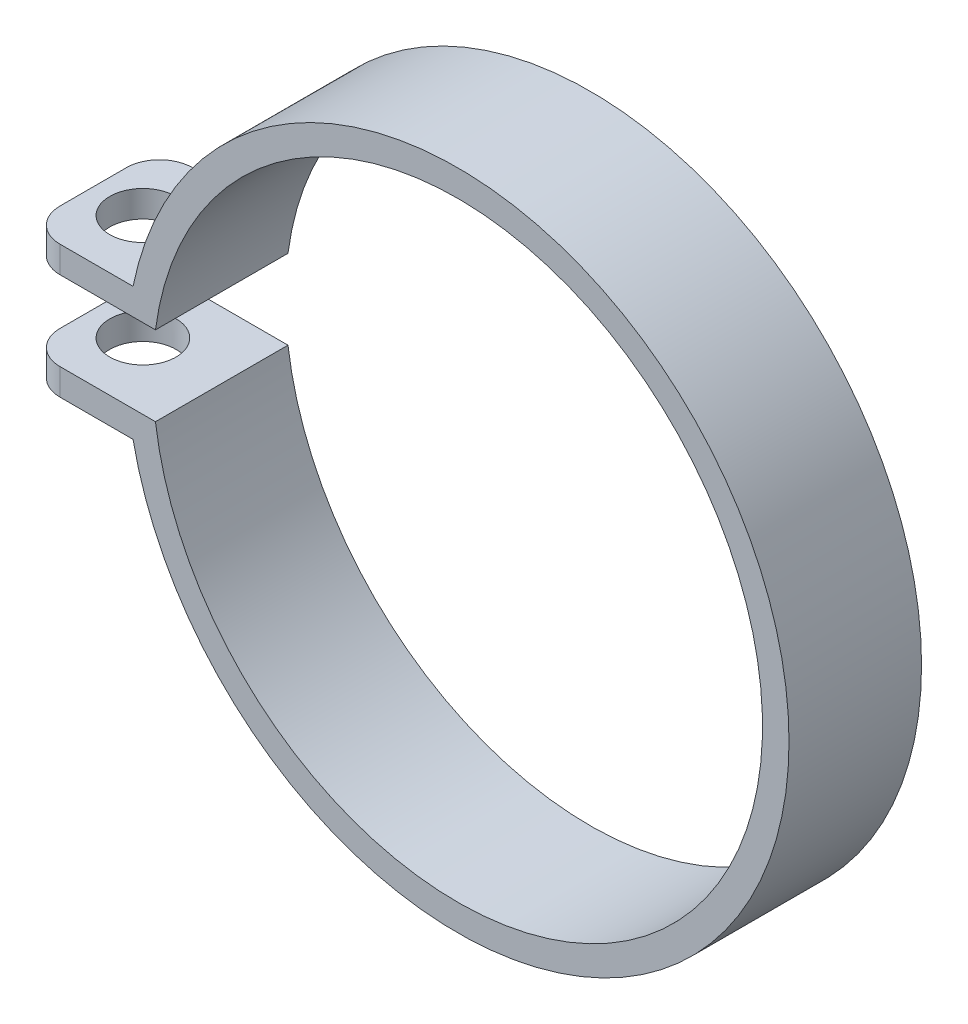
ISO-10303-21;
HEADER;
FILE_DESCRIPTION(('STEP AP214'),'2;1');
FILE_NAME('part.step','',(''),(''),'','','');
FILE_SCHEMA(('AUTOMOTIVE_DESIGN { 1 0 10303 214 1 1 1 1 }'));
ENDSEC;
DATA;
#1=APPLICATION_CONTEXT('core data for automotive mechanical design processes');
#2=APPLICATION_PROTOCOL_DEFINITION('international standard','automotive_design',2000,#1);
#3=PRODUCT_CONTEXT('',#1,'mechanical');
#4=PRODUCT('Part','Part','',(#3));
#5=PRODUCT_RELATED_PRODUCT_CATEGORY('part','',(#4));
#6=PRODUCT_DEFINITION_FORMATION('','',#4);
#7=PRODUCT_DEFINITION_CONTEXT('part definition',#1,'design');
#8=PRODUCT_DEFINITION('design','',#6,#7);
#9=PRODUCT_DEFINITION_SHAPE('','',#8);
#10=(LENGTH_UNIT() NAMED_UNIT(*) SI_UNIT(.MILLI.,.METRE.));
#11=(NAMED_UNIT(*) PLANE_ANGLE_UNIT() SI_UNIT($,.RADIAN.));
#12=(NAMED_UNIT(*) SI_UNIT($,.STERADIAN.) SOLID_ANGLE_UNIT());
#13=UNCERTAINTY_MEASURE_WITH_UNIT(LENGTH_MEASURE(1.E-05),#10,'distance_accuracy_value','');
#14=(GEOMETRIC_REPRESENTATION_CONTEXT(3) GLOBAL_UNCERTAINTY_ASSIGNED_CONTEXT((#13)) GLOBAL_UNIT_ASSIGNED_CONTEXT((#10,
#11,#12)) REPRESENTATION_CONTEXT('',''));
#15=CARTESIAN_POINT('',(0.,0.,0.));
#16=DIRECTION('',(0.,0.,1.));
#17=DIRECTION('',(1.,0.,0.));
#18=AXIS2_PLACEMENT_3D('',#15,#16,#17);
#19=CARTESIAN_POINT('',(0.,0.,10.));
#20=DIRECTION('',(0.,0.,-1.));
#21=DIRECTION('',(-1.,0.,0.));
#22=AXIS2_PLACEMENT_3D('',#19,#20,#21);
#23=CYLINDRICAL_SURFACE('',#22,46.);
#24=CARTESIAN_POINT('',(0.,0.,-10.));
#25=DIRECTION('',(0.,0.,-1.));
#26=DIRECTION('',(1.,0.,0.));
#27=AXIS2_PLACEMENT_3D('',#24,#25,#26);
#28=CIRCLE('',#27,46.);
#29=CARTESIAN_POINT('',(-45.6070170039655,5.99999999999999,-10.));
#30=VERTEX_POINT('',#29);
#31=CARTESIAN_POINT('',(-45.6070170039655,-6.00000000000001,-10.));
#32=VERTEX_POINT('',#31);
#33=EDGE_CURVE('E153',#30,#32,#28,.T.);
#34=ORIENTED_EDGE('',*,*,#33,.T.);
#35=DIRECTION('',(0.,0.,-1.));
#36=VECTOR('',#35,1.);
#37=CARTESIAN_POINT('',(-45.6070170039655,-6.00000000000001,10.));
#38=LINE('',#37,#36);
#39=CARTESIAN_POINT('',(-45.6070170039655,-6.00000000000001,10.));
#40=VERTEX_POINT('',#39);
#41=EDGE_CURVE('E132',#40,#32,#38,.T.);
#42=ORIENTED_EDGE('',*,*,#41,.F.);
#43=CARTESIAN_POINT('',(0.,0.,10.));
#44=DIRECTION('',(0.,0.,-1.));
#45=DIRECTION('',(1.,0.,0.));
#46=AXIS2_PLACEMENT_3D('',#43,#44,#45);
#47=CIRCLE('',#46,46.);
#48=CARTESIAN_POINT('',(-45.6070170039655,5.99999999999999,10.));
#49=VERTEX_POINT('',#48);
#50=EDGE_CURVE('E140',#49,#40,#47,.T.);
#51=ORIENTED_EDGE('',*,*,#50,.F.);
#52=DIRECTION('',(0.,0.,-1.));
#53=VECTOR('',#52,1.);
#54=CARTESIAN_POINT('',(-45.6070170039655,5.99999999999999,10.));
#55=LINE('',#54,#53);
#56=EDGE_CURVE('E208',#49,#30,#55,.T.);
#57=ORIENTED_EDGE('',*,*,#56,.T.);
#58=EDGE_LOOP('',(#34,#42,#51,#57));
#59=FACE_BOUND('',#58,.T.);
#60=ADVANCED_FACE('F36',(#59),#23,.F.);
#61=CARTESIAN_POINT('',(-45.6070170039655,-6.00000000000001,10.));
#62=DIRECTION('',(0.,-1.,0.));
#63=DIRECTION('',(0.,0.,-1.));
#64=AXIS2_PLACEMENT_3D('',#61,#62,#63);
#65=PLANE('',#64);
#66=CARTESIAN_POINT('',(-57.5,-6.00000000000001,0.));
#67=DIRECTION('',(0.,-1.,0.));
#68=DIRECTION('',(0.,0.,-1.));
#69=AXIS2_PLACEMENT_3D('',#66,#67,#68);
#70=CIRCLE('',#69,5.);
#71=CARTESIAN_POINT('',(-57.5,-6.00000000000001,-5.));
#72=VERTEX_POINT('',#71);
#73=EDGE_CURVE('E237',#72,#72,#70,.T.);
#74=ORIENTED_EDGE('',*,*,#73,.T.);
#75=EDGE_LOOP('',(#74));
#76=FACE_BOUND('',#75,.T.);
#77=DIRECTION('',(0.,0.,-1.));
#78=VECTOR('',#77,1.);
#79=CARTESIAN_POINT('',(-65.,-6.00000000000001,10.));
#80=LINE('',#79,#78);
#81=CARTESIAN_POINT('',(-65.,-6.00000000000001,5.));
#82=VERTEX_POINT('',#81);
#83=CARTESIAN_POINT('',(-65.,-6.00000000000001,-5.));
#84=VERTEX_POINT('',#83);
#85=EDGE_CURVE('E155',#82,#84,#80,.T.);
#86=ORIENTED_EDGE('',*,*,#85,.F.);
#87=CARTESIAN_POINT('',(-60.,-6.00000000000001,5.));
#88=DIRECTION('',(0.,-1.,0.));
#89=DIRECTION('',(0.,0.,-1.));
#90=AXIS2_PLACEMENT_3D('',#87,#88,#89);
#91=CIRCLE('',#90,5.);
#92=CARTESIAN_POINT('',(-60.,-6.00000000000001,10.));
#93=VERTEX_POINT('',#92);
#94=EDGE_CURVE('E135',#82,#93,#91,.F.);
#95=ORIENTED_EDGE('',*,*,#94,.T.);
#96=DIRECTION('',(-1.,0.,0.));
#97=VECTOR('',#96,1.);
#98=CARTESIAN_POINT('',(-45.6070170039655,-6.00000000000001,10.));
#99=LINE('',#98,#97);
#100=EDGE_CURVE('E126',#40,#93,#99,.T.);
#101=ORIENTED_EDGE('',*,*,#100,.F.);
#102=ORIENTED_EDGE('',*,*,#41,.T.);
#103=DIRECTION('',(-1.,0.,0.));
#104=VECTOR('',#103,1.);
#105=CARTESIAN_POINT('',(-45.6070170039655,-6.00000000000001,-10.));
#106=LINE('',#105,#104);
#107=CARTESIAN_POINT('',(-60.,-6.00000000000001,-10.));
#108=VERTEX_POINT('',#107);
#109=EDGE_CURVE('E236',#32,#108,#106,.T.);
#110=ORIENTED_EDGE('',*,*,#109,.T.);
#111=CARTESIAN_POINT('',(-60.,-6.00000000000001,-5.));
#112=DIRECTION('',(0.,-1.,0.));
#113=DIRECTION('',(0.,0.,-1.));
#114=AXIS2_PLACEMENT_3D('',#111,#112,#113);
#115=CIRCLE('',#114,5.);
#116=EDGE_CURVE('E174',#108,#84,#115,.F.);
#117=ORIENTED_EDGE('',*,*,#116,.T.);
#118=EDGE_LOOP('',(#86,#95,#101,#102,#110,#117));
#119=FACE_BOUND('',#118,.T.);
#120=ADVANCED_FACE('F129',(#76,#119),#65,.F.);
#121=CARTESIAN_POINT('',(-65.,-10.,10.));
#122=DIRECTION('',(1.,0.,0.));
#123=DIRECTION('',(0.,0.,-1.));
#124=AXIS2_PLACEMENT_3D('',#121,#122,#123);
#125=PLANE('',#124);
#126=DIRECTION('',(0.,0.,-1.));
#127=VECTOR('',#126,1.);
#128=CARTESIAN_POINT('',(-65.,-10.,10.));
#129=LINE('',#128,#127);
#130=CARTESIAN_POINT('',(-65.,-10.,5.));
#131=VERTEX_POINT('',#130);
#132=CARTESIAN_POINT('',(-65.,-10.,-5.));
#133=VERTEX_POINT('',#132);
#134=EDGE_CURVE('E160',#131,#133,#129,.T.);
#135=ORIENTED_EDGE('',*,*,#134,.F.);
#136=DIRECTION('',(0.,-1.,0.));
#137=VECTOR('',#136,1.);
#138=CARTESIAN_POINT('',(-65.,-6.00000000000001,5.));
#139=LINE('',#138,#137);
#140=EDGE_CURVE('E172',#131,#82,#139,.F.);
#141=ORIENTED_EDGE('',*,*,#140,.T.);
#142=ORIENTED_EDGE('',*,*,#85,.T.);
#143=DIRECTION('',(0.,-1.,0.));
#144=VECTOR('',#143,1.);
#145=CARTESIAN_POINT('',(-65.,-10.,-5.));
#146=LINE('',#145,#144);
#147=EDGE_CURVE('E169',#84,#133,#146,.T.);
#148=ORIENTED_EDGE('',*,*,#147,.T.);
#149=EDGE_LOOP('',(#135,#141,#142,#148));
#150=FACE_BOUND('',#149,.T.);
#151=ADVANCED_FACE('F226',(#150),#125,.F.);
#152=CARTESIAN_POINT('',(-48.9897948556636,-10.,10.));
#153=DIRECTION('',(0.,1.,0.));
#154=DIRECTION('',(-1.,0.,0.));
#155=AXIS2_PLACEMENT_3D('',#152,#153,#154);
#156=PLANE('',#155);
#157=CARTESIAN_POINT('',(-57.5,-10.,0.));
#158=DIRECTION('',(0.,1.,0.));
#159=DIRECTION('',(-1.,0.,0.));
#160=AXIS2_PLACEMENT_3D('',#157,#158,#159);
#161=CIRCLE('',#160,5.);
#162=CARTESIAN_POINT('',(-62.5,-10.,0.));
#163=VERTEX_POINT('',#162);
#164=EDGE_CURVE('E301',#163,#163,#161,.F.);
#165=ORIENTED_EDGE('',*,*,#164,.F.);
#166=EDGE_LOOP('',(#165));
#167=FACE_BOUND('',#166,.T.);
#168=DIRECTION('',(1.,0.,0.));
#169=VECTOR('',#168,1.);
#170=CARTESIAN_POINT('',(-48.9897948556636,-10.,10.));
#171=LINE('',#170,#169);
#172=CARTESIAN_POINT('',(-60.,-10.,10.));
#173=VERTEX_POINT('',#172);
#174=CARTESIAN_POINT('',(-48.9897948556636,-10.,10.));
#175=VERTEX_POINT('',#174);
#176=EDGE_CURVE('E139',#173,#175,#171,.T.);
#177=ORIENTED_EDGE('',*,*,#176,.F.);
#178=CARTESIAN_POINT('',(-60.,-10.,5.));
#179=DIRECTION('',(0.,1.,0.));
#180=DIRECTION('',(-1.,0.,0.));
#181=AXIS2_PLACEMENT_3D('',#178,#179,#180);
#182=CIRCLE('',#181,5.);
#183=EDGE_CURVE('E167',#173,#131,#182,.F.);
#184=ORIENTED_EDGE('',*,*,#183,.T.);
#185=ORIENTED_EDGE('',*,*,#134,.T.);
#186=CARTESIAN_POINT('',(-60.,-10.,-5.));
#187=DIRECTION('',(0.,1.,0.));
#188=DIRECTION('',(-1.,0.,0.));
#189=AXIS2_PLACEMENT_3D('',#186,#187,#188);
#190=CIRCLE('',#189,5.);
#191=CARTESIAN_POINT('',(-60.,-10.,-10.));
#192=VERTEX_POINT('',#191);
#193=EDGE_CURVE('E165',#133,#192,#190,.F.);
#194=ORIENTED_EDGE('',*,*,#193,.T.);
#195=DIRECTION('',(1.,0.,0.));
#196=VECTOR('',#195,1.);
#197=CARTESIAN_POINT('',(-48.9897948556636,-10.,-10.));
#198=LINE('',#197,#196);
#199=CARTESIAN_POINT('',(-48.9897948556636,-10.,-10.));
#200=VERTEX_POINT('',#199);
#201=EDGE_CURVE('E239',#192,#200,#198,.T.);
#202=ORIENTED_EDGE('',*,*,#201,.T.);
#203=DIRECTION('',(0.,0.,-1.));
#204=VECTOR('',#203,1.);
#205=CARTESIAN_POINT('',(-48.9897948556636,-10.,10.));
#206=LINE('',#205,#204);
#207=EDGE_CURVE('E216',#175,#200,#206,.T.);
#208=ORIENTED_EDGE('',*,*,#207,.F.);
#209=EDGE_LOOP('',(#177,#184,#185,#194,#202,#208));
#210=FACE_BOUND('',#209,.T.);
#211=ADVANCED_FACE('F222',(#167,#210),#156,.F.);
#212=CARTESIAN_POINT('',(0.,0.,10.));
#213=DIRECTION('',(0.,0.,-1.));
#214=DIRECTION('',(-1.,0.,0.));
#215=AXIS2_PLACEMENT_3D('',#212,#213,#214);
#216=CYLINDRICAL_SURFACE('',#215,50.);
#217=CARTESIAN_POINT('',(0.,0.,-10.));
#218=DIRECTION('',(0.,0.,1.));
#219=DIRECTION('',(1.,0.,0.));
#220=AXIS2_PLACEMENT_3D('',#217,#218,#219);
#221=CIRCLE('',#220,50.);
#222=CARTESIAN_POINT('',(-48.9897948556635,10.,-10.));
#223=VERTEX_POINT('',#222);
#224=EDGE_CURVE('E241',#200,#223,#221,.T.);
#225=ORIENTED_EDGE('',*,*,#224,.T.);
#226=DIRECTION('',(0.,0.,-1.));
#227=VECTOR('',#226,1.);
#228=CARTESIAN_POINT('',(-48.9897948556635,10.,10.));
#229=LINE('',#228,#227);
#230=CARTESIAN_POINT('',(-48.9897948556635,10.,10.));
#231=VERTEX_POINT('',#230);
#232=EDGE_CURVE('E210',#231,#223,#229,.T.);
#233=ORIENTED_EDGE('',*,*,#232,.F.);
#234=CARTESIAN_POINT('',(0.,0.,10.));
#235=DIRECTION('',(0.,0.,1.));
#236=DIRECTION('',(1.,0.,0.));
#237=AXIS2_PLACEMENT_3D('',#234,#235,#236);
#238=CIRCLE('',#237,50.);
#239=EDGE_CURVE('E199',#175,#231,#238,.T.);
#240=ORIENTED_EDGE('',*,*,#239,.F.);
#241=ORIENTED_EDGE('',*,*,#207,.T.);
#242=EDGE_LOOP('',(#225,#233,#240,#241));
#243=FACE_BOUND('',#242,.T.);
#244=ADVANCED_FACE('F273',(#243),#216,.T.);
#245=CARTESIAN_POINT('',(-65.,9.99999999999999,10.));
#246=DIRECTION('',(0.,-1.,0.));
#247=DIRECTION('',(0.,0.,-1.));
#248=AXIS2_PLACEMENT_3D('',#245,#246,#247);
#249=PLANE('',#248);
#250=CARTESIAN_POINT('',(-57.5,9.99999999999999,0.));
#251=DIRECTION('',(0.,1.,0.));
#252=DIRECTION('',(0.,0.,1.));
#253=AXIS2_PLACEMENT_3D('',#250,#251,#252);
#254=CIRCLE('',#253,5.);
#255=CARTESIAN_POINT('',(-57.5,9.99999999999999,5.));
#256=VERTEX_POINT('',#255);
#257=EDGE_CURVE('E308',#256,#256,#254,.T.);
#258=ORIENTED_EDGE('',*,*,#257,.F.);
#259=EDGE_LOOP('',(#258));
#260=FACE_BOUND('',#259,.T.);
#261=DIRECTION('',(-1.,0.,0.));
#262=VECTOR('',#261,1.);
#263=CARTESIAN_POINT('',(-65.,9.99999999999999,-10.));
#264=LINE('',#263,#262);
#265=CARTESIAN_POINT('',(-60.,9.99999999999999,-10.));
#266=VERTEX_POINT('',#265);
#267=EDGE_CURVE('E243',#223,#266,#264,.T.);
#268=ORIENTED_EDGE('',*,*,#267,.T.);
#269=CARTESIAN_POINT('',(-60.,9.99999999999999,-5.));
#270=DIRECTION('',(0.,-1.,0.));
#271=DIRECTION('',(0.,0.,-1.));
#272=AXIS2_PLACEMENT_3D('',#269,#270,#271);
#273=CIRCLE('',#272,5.);
#274=CARTESIAN_POINT('',(-65.,9.99999999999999,-5.));
#275=VERTEX_POINT('',#274);
#276=EDGE_CURVE('E11',#266,#275,#273,.F.);
#277=ORIENTED_EDGE('',*,*,#276,.T.);
#278=DIRECTION('',(0.,0.,-1.));
#279=VECTOR('',#278,1.);
#280=CARTESIAN_POINT('',(-65.,9.99999999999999,10.));
#281=LINE('',#280,#279);
#282=CARTESIAN_POINT('',(-65.,9.99999999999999,5.));
#283=VERTEX_POINT('',#282);
#284=EDGE_CURVE('E195',#283,#275,#281,.T.);
#285=ORIENTED_EDGE('',*,*,#284,.F.);
#286=CARTESIAN_POINT('',(-60.,9.99999999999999,5.));
#287=DIRECTION('',(0.,-1.,0.));
#288=DIRECTION('',(0.,0.,-1.));
#289=AXIS2_PLACEMENT_3D('',#286,#287,#288);
#290=CIRCLE('',#289,5.);
#291=CARTESIAN_POINT('',(-60.,9.99999999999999,10.));
#292=VERTEX_POINT('',#291);
#293=EDGE_CURVE('E45',#283,#292,#290,.F.);
#294=ORIENTED_EDGE('',*,*,#293,.T.);
#295=DIRECTION('',(-1.,0.,0.));
#296=VECTOR('',#295,1.);
#297=CARTESIAN_POINT('',(-65.,9.99999999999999,10.));
#298=LINE('',#297,#296);
#299=EDGE_CURVE('E194',#231,#292,#298,.T.);
#300=ORIENTED_EDGE('',*,*,#299,.F.);
#301=ORIENTED_EDGE('',*,*,#232,.T.);
#302=EDGE_LOOP('',(#268,#277,#285,#294,#300,#301));
#303=FACE_BOUND('',#302,.T.);
#304=ADVANCED_FACE('F192',(#260,#303),#249,.F.);
#305=CARTESIAN_POINT('',(-65.,5.99999999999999,10.));
#306=DIRECTION('',(1.,0.,0.));
#307=DIRECTION('',(0.,0.,-1.));
#308=AXIS2_PLACEMENT_3D('',#305,#306,#307);
#309=PLANE('',#308);
#310=ORIENTED_EDGE('',*,*,#284,.T.);
#311=DIRECTION('',(0.,-1.,0.));
#312=VECTOR('',#311,1.);
#313=CARTESIAN_POINT('',(-65.,5.99999999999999,-5.));
#314=LINE('',#313,#312);
#315=CARTESIAN_POINT('',(-65.,5.99999999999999,-5.));
#316=VERTEX_POINT('',#315);
#317=EDGE_CURVE('E182',#275,#316,#314,.T.);
#318=ORIENTED_EDGE('',*,*,#317,.T.);
#319=DIRECTION('',(0.,0.,-1.));
#320=VECTOR('',#319,1.);
#321=CARTESIAN_POINT('',(-65.,5.99999999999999,10.));
#322=LINE('',#321,#320);
#323=CARTESIAN_POINT('',(-65.,5.99999999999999,5.));
#324=VERTEX_POINT('',#323);
#325=EDGE_CURVE('E205',#324,#316,#322,.T.);
#326=ORIENTED_EDGE('',*,*,#325,.F.);
#327=DIRECTION('',(0.,-1.,0.));
#328=VECTOR('',#327,1.);
#329=CARTESIAN_POINT('',(-65.,9.99999999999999,5.));
#330=LINE('',#329,#328);
#331=EDGE_CURVE('E57',#324,#283,#330,.F.);
#332=ORIENTED_EDGE('',*,*,#331,.T.);
#333=EDGE_LOOP('',(#310,#318,#326,#332));
#334=FACE_BOUND('',#333,.T.);
#335=ADVANCED_FACE('F206',(#334),#309,.F.);
#336=CARTESIAN_POINT('',(-65.,5.99999999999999,10.));
#337=DIRECTION('',(0.,1.,0.));
#338=DIRECTION('',(0.,0.,1.));
#339=AXIS2_PLACEMENT_3D('',#336,#337,#338);
#340=PLANE('',#339);
#341=CARTESIAN_POINT('',(-57.5,5.99999999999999,0.));
#342=DIRECTION('',(0.,1.,0.));
#343=DIRECTION('',(0.,0.,1.));
#344=AXIS2_PLACEMENT_3D('',#341,#342,#343);
#345=CIRCLE('',#344,5.);
#346=CARTESIAN_POINT('',(-57.5,5.99999999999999,5.));
#347=VERTEX_POINT('',#346);
#348=EDGE_CURVE('E40',#347,#347,#345,.T.);
#349=ORIENTED_EDGE('',*,*,#348,.T.);
#350=EDGE_LOOP('',(#349));
#351=FACE_BOUND('',#350,.T.);
#352=ORIENTED_EDGE('',*,*,#325,.T.);
#353=CARTESIAN_POINT('',(-60.,5.99999999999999,-5.));
#354=DIRECTION('',(0.,1.,0.));
#355=DIRECTION('',(0.,0.,1.));
#356=AXIS2_PLACEMENT_3D('',#353,#354,#355);
#357=CIRCLE('',#356,5.);
#358=CARTESIAN_POINT('',(-60.,5.99999999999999,-10.));
#359=VERTEX_POINT('',#358);
#360=EDGE_CURVE('E187',#316,#359,#357,.F.);
#361=ORIENTED_EDGE('',*,*,#360,.T.);
#362=DIRECTION('',(1.,0.,0.));
#363=VECTOR('',#362,1.);
#364=CARTESIAN_POINT('',(-65.,5.99999999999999,-10.));
#365=LINE('',#364,#363);
#366=EDGE_CURVE('E150',#359,#30,#365,.T.);
#367=ORIENTED_EDGE('',*,*,#366,.T.);
#368=ORIENTED_EDGE('',*,*,#56,.F.);
#369=DIRECTION('',(1.,0.,0.));
#370=VECTOR('',#369,1.);
#371=CARTESIAN_POINT('',(-65.,5.99999999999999,10.));
#372=LINE('',#371,#370);
#373=CARTESIAN_POINT('',(-60.,5.99999999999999,10.));
#374=VERTEX_POINT('',#373);
#375=EDGE_CURVE('E146',#374,#49,#372,.T.);
#376=ORIENTED_EDGE('',*,*,#375,.F.);
#377=CARTESIAN_POINT('',(-60.,5.99999999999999,5.));
#378=DIRECTION('',(0.,1.,0.));
#379=DIRECTION('',(0.,0.,1.));
#380=AXIS2_PLACEMENT_3D('',#377,#378,#379);
#381=CIRCLE('',#380,5.);
#382=EDGE_CURVE('E185',#374,#324,#381,.F.);
#383=ORIENTED_EDGE('',*,*,#382,.T.);
#384=EDGE_LOOP('',(#352,#361,#367,#368,#376,#383));
#385=FACE_BOUND('',#384,.T.);
#386=ADVANCED_FACE('F204',(#351,#385),#340,.F.);
#387=CARTESIAN_POINT('',(0.,0.,10.));
#388=DIRECTION('',(0.,0.,1.));
#389=DIRECTION('',(1.,0.,0.));
#390=AXIS2_PLACEMENT_3D('',#387,#388,#389);
#391=PLANE('',#390);
#392=ORIENTED_EDGE('',*,*,#100,.T.);
#393=DIRECTION('',(0.,-1.,0.));
#394=VECTOR('',#393,1.);
#395=CARTESIAN_POINT('',(-60.,-10.,10.));
#396=LINE('',#395,#394);
#397=EDGE_CURVE('E157',#93,#173,#396,.T.);
#398=ORIENTED_EDGE('',*,*,#397,.T.);
#399=ORIENTED_EDGE('',*,*,#176,.T.);
#400=ORIENTED_EDGE('',*,*,#239,.T.);
#401=ORIENTED_EDGE('',*,*,#299,.T.);
#402=DIRECTION('',(0.,-1.,0.));
#403=VECTOR('',#402,1.);
#404=CARTESIAN_POINT('',(-60.,5.99999999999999,10.));
#405=LINE('',#404,#403);
#406=EDGE_CURVE('E154',#292,#374,#405,.T.);
#407=ORIENTED_EDGE('',*,*,#406,.T.);
#408=ORIENTED_EDGE('',*,*,#375,.T.);
#409=ORIENTED_EDGE('',*,*,#50,.T.);
#410=EDGE_LOOP('',(#392,#398,#399,#400,#401,#407,#408,#409));
#411=FACE_BOUND('',#410,.T.);
#412=ADVANCED_FACE('F143',(#411),#391,.T.);
#413=CARTESIAN_POINT('',(0.,0.,-10.));
#414=DIRECTION('',(0.,0.,1.));
#415=DIRECTION('',(1.,0.,0.));
#416=AXIS2_PLACEMENT_3D('',#413,#414,#415);
#417=PLANE('',#416);
#418=ORIENTED_EDGE('',*,*,#201,.F.);
#419=DIRECTION('',(0.,-1.,0.));
#420=VECTOR('',#419,1.);
#421=CARTESIAN_POINT('',(-60.,0.,-10.));
#422=LINE('',#421,#420);
#423=EDGE_CURVE('E179',#192,#108,#422,.F.);
#424=ORIENTED_EDGE('',*,*,#423,.T.);
#425=ORIENTED_EDGE('',*,*,#109,.F.);
#426=ORIENTED_EDGE('',*,*,#33,.F.);
#427=ORIENTED_EDGE('',*,*,#366,.F.);
#428=DIRECTION('',(0.,-1.,0.));
#429=VECTOR('',#428,1.);
#430=CARTESIAN_POINT('',(-60.,0.,-10.));
#431=LINE('',#430,#429);
#432=EDGE_CURVE('E177',#359,#266,#431,.F.);
#433=ORIENTED_EDGE('',*,*,#432,.T.);
#434=ORIENTED_EDGE('',*,*,#267,.F.);
#435=ORIENTED_EDGE('',*,*,#224,.F.);
#436=EDGE_LOOP('',(#418,#424,#425,#426,#427,#433,#434,#435));
#437=FACE_BOUND('',#436,.T.);
#438=ADVANCED_FACE('F247',(#437),#417,.F.);
#439=CARTESIAN_POINT('',(-60.,0.,5.));
#440=DIRECTION('',(0.,1.,0.));
#441=DIRECTION('',(0.,0.,1.));
#442=AXIS2_PLACEMENT_3D('',#439,#440,#441);
#443=CYLINDRICAL_SURFACE('',#442,5.);
#444=ORIENTED_EDGE('',*,*,#94,.F.);
#445=ORIENTED_EDGE('',*,*,#140,.F.);
#446=ORIENTED_EDGE('',*,*,#183,.F.);
#447=ORIENTED_EDGE('',*,*,#397,.F.);
#448=EDGE_LOOP('',(#444,#445,#446,#447));
#449=FACE_BOUND('',#448,.T.);
#450=ADVANCED_FACE('F229',(#449),#443,.T.);
#451=CARTESIAN_POINT('',(-60.,-10.,-5.));
#452=DIRECTION('',(0.,-1.,0.));
#453=DIRECTION('',(0.,0.,-1.));
#454=AXIS2_PLACEMENT_3D('',#451,#452,#453);
#455=CYLINDRICAL_SURFACE('',#454,5.);
#456=ORIENTED_EDGE('',*,*,#116,.F.);
#457=ORIENTED_EDGE('',*,*,#423,.F.);
#458=ORIENTED_EDGE('',*,*,#193,.F.);
#459=ORIENTED_EDGE('',*,*,#147,.F.);
#460=EDGE_LOOP('',(#456,#457,#458,#459));
#461=FACE_BOUND('',#460,.T.);
#462=ADVANCED_FACE('F251',(#461),#455,.T.);
#463=CARTESIAN_POINT('',(-60.,5.99999999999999,-5.));
#464=DIRECTION('',(0.,-1.,0.));
#465=DIRECTION('',(0.,0.,-1.));
#466=AXIS2_PLACEMENT_3D('',#463,#464,#465);
#467=CYLINDRICAL_SURFACE('',#466,5.);
#468=ORIENTED_EDGE('',*,*,#276,.F.);
#469=ORIENTED_EDGE('',*,*,#432,.F.);
#470=ORIENTED_EDGE('',*,*,#360,.F.);
#471=ORIENTED_EDGE('',*,*,#317,.F.);
#472=EDGE_LOOP('',(#468,#469,#470,#471));
#473=FACE_BOUND('',#472,.T.);
#474=ADVANCED_FACE('F253',(#473),#467,.T.);
#475=CARTESIAN_POINT('',(-60.,0.,5.));
#476=DIRECTION('',(0.,1.,0.));
#477=DIRECTION('',(0.,0.,1.));
#478=AXIS2_PLACEMENT_3D('',#475,#476,#477);
#479=CYLINDRICAL_SURFACE('',#478,5.);
#480=ORIENTED_EDGE('',*,*,#293,.F.);
#481=ORIENTED_EDGE('',*,*,#331,.F.);
#482=ORIENTED_EDGE('',*,*,#382,.F.);
#483=ORIENTED_EDGE('',*,*,#406,.F.);
#484=EDGE_LOOP('',(#480,#481,#482,#483));
#485=FACE_BOUND('',#484,.T.);
#486=ADVANCED_FACE('F38',(#485),#479,.T.);
#487=CARTESIAN_POINT('',(-57.5,-24.142135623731,0.));
#488=DIRECTION('',(0.,1.,0.));
#489=DIRECTION('',(0.,0.,1.));
#490=AXIS2_PLACEMENT_3D('',#487,#488,#489);
#491=CYLINDRICAL_SURFACE('',#490,5.);
#492=ORIENTED_EDGE('',*,*,#257,.T.);
#493=EDGE_LOOP('',(#492));
#494=FACE_BOUND('',#493,.T.);
#495=ORIENTED_EDGE('',*,*,#348,.F.);
#496=EDGE_LOOP('',(#495));
#497=FACE_BOUND('',#496,.T.);
#498=ADVANCED_FACE('F292',(#494,#497),#491,.F.);
#499=ORIENTED_EDGE('',*,*,#164,.T.);
#500=EDGE_LOOP('',(#499));
#501=FACE_BOUND('',#500,.T.);
#502=ORIENTED_EDGE('',*,*,#73,.F.);
#503=EDGE_LOOP('',(#502));
#504=FACE_BOUND('',#503,.T.);
#505=ADVANCED_FACE('F290',(#501,#504),#491,.F.);
#506=CLOSED_SHELL('',(#60,#120,#151,#211,#244,#304,#335,#386,#412,#438,#450,#462,#474,#486,#498,#505));
#507=MANIFOLD_SOLID_BREP('B2',#506);
#508=ADVANCED_BREP_SHAPE_REPRESENTATION('',(#18,#507),#14);
#509=SHAPE_DEFINITION_REPRESENTATION(#9,#508);
ENDSEC;
END-ISO-10303-21;
